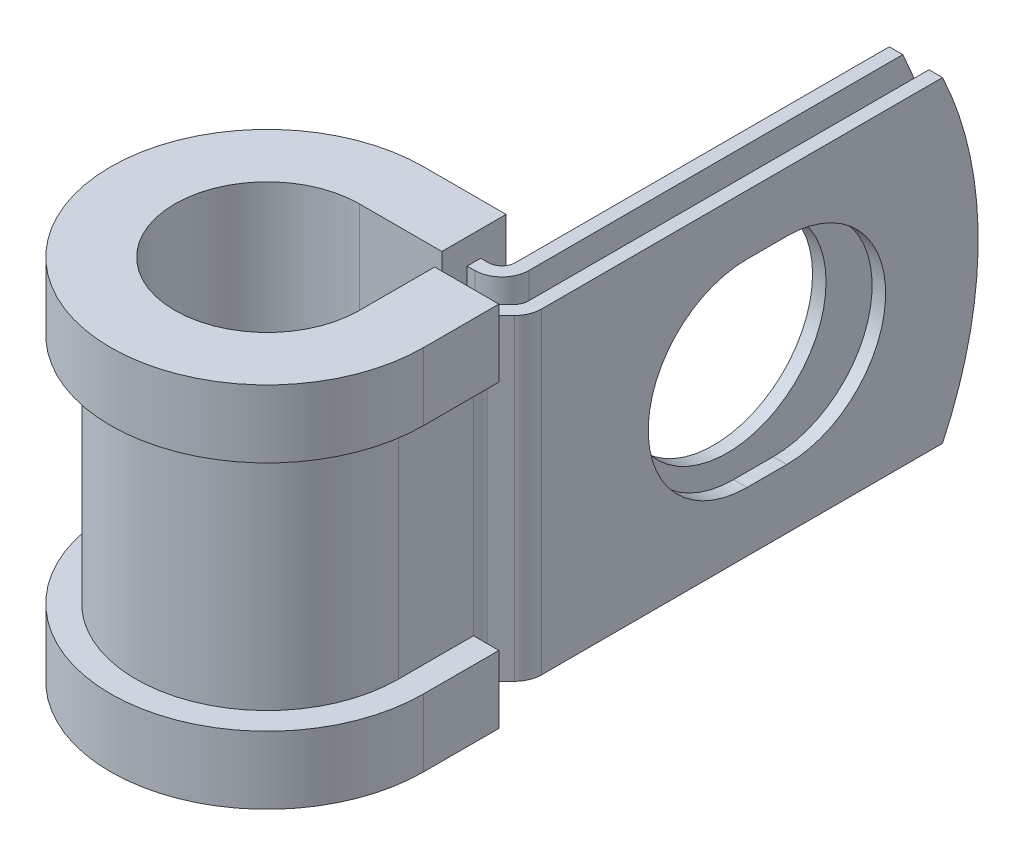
from build123d import *

# Parameters (mm, degrees)
EXTRUDE_THIN1_DEPTH = 9.525
SKETCH2_R           = 5.9436
CUT_EXTRUDE1_DEPTH  = 0.8128
CUT_EXTRUDE2_DEPTH  = 0.8128
CUT_EXTRUDE3_DEPTH  = 38.422656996


with BuildPart() as part:
    # Sketch1 → Extrude-Thin1 (new, symmetric)
    with BuildSketch(Plane(origin=(0, 0, 0), x_dir=(1, 0, 0), z_dir=(0, 1, 0))):
        with BuildLine():
            Line((8.614274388, 33.3248), (8.614274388, 7.0739))
            ThreePointArc((8.614274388, 7.0739), (8.552403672, 6.762854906), (8.37621078, 6.499163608))
            Line((8.37621078, 6.499163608), (7.550027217, 5.672980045))
            ThreePointArc((7.550027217, 5.672980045), (7.197641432, 5.145597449), (7.0739, 4.523507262))
            Line((7.0739, 4.523507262), (7.0739, 0))
            ThreePointArc((7.0739, 0), (-5.002002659, -5.002002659), (0, 7.0739))
            Line((0, 7.0739), (5.413874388, 7.0739))
            ThreePointArc((5.413874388, 7.0739), (6.563347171, 7.550027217), (7.039474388, 8.6995))
            Line((7.039474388, 8.6995), (7.039474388, 33.3248))
            Line((7.039474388, 33.3248), (6.226674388, 33.3248))
            Line((6.226674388, 33.3248), (6.226674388, 8.6995))
            ThreePointArc((6.226674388, 8.6995), (5.98861078, 8.124763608), (5.413874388, 7.8867))
            Line((5.413874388, 7.8867), (0, 7.8867))
            ThreePointArc((0, 7.8867), (-5.576739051, -5.576739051), (7.8867, 0))
            Line((7.8867, 0), (7.8867, 4.523507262))
            ThreePointArc((7.8867, 4.523507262), (7.948570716, 4.834552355), (8.124763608, 5.098243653))
            Line((8.124763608, 5.098243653), (8.950947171, 5.924427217))
            ThreePointArc((8.950947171, 5.924427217), (9.303332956, 6.451809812), (9.427074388, 7.0739))
            Line((9.427074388, 7.0739), (9.427074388, 33.3248))
            Line((9.427074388, 33.3248), (8.614274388, 33.3248))
        make_face()
    extrude(amount=EXTRUDE_THIN1_DEPTH, both=True)

    # Sketch2 → Cut-Extrude1 (cut)
    with BuildSketch(Plane.ZY.offset(-6.226674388)):
        with Locations((-20.6248, 0)):
            Circle(SKETCH2_R)
    extrude(amount=-CUT_EXTRUDE1_DEPTH, mode=Mode.SUBTRACT)

    # Sketch3 → Cut-Extrude2 (cut)
    with BuildSketch(Plane(origin=(9.427074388, 0, 0), x_dir=(0, 0, -1), z_dir=(1, 0, 0))):
        with BuildLine():
            Line((19.431, 5.9436), (21.8186, 5.9436))
            ThreePointArc((21.8186, 5.9436), (27.7622, 0), (21.8186, -5.9436))
            Line((21.8186, -5.9436), (19.431, -5.9436))
            ThreePointArc((19.431, -5.9436), (13.4874, 0), (19.431, 5.9436))
        make_face()
    extrude(amount=-CUT_EXTRUDE2_DEPTH, mode=Mode.SUBTRACT)

    # Sketch4 → Cut-Extrude3 (cut, through all)
    with BuildSketch(Plane.ZY.offset(-6.226674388)):
        with BuildLine():
            Line((-31.180263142, 9.525), (-33.3248, 9.525))
            Line((-33.3248, 9.525), (-33.3248, 0))
            ThreePointArc((-33.3248, 0), (-32.782038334, 4.881717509), (-31.180263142, 9.525))
        make_face()
        with BuildLine():
            ThreePointArc((-31.180263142, -9.525), (-32.782038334, -4.881717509), (-33.3248, 0))
            Line((-33.3248, 0), (-33.3248, -9.525))
            Line((-33.3248, -9.525), (-31.180263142, -9.525))
        make_face()
    extrude(amount=-CUT_EXTRUDE3_DEPTH, mode=Mode.SUBTRACT)

    # Sweep1: sweep along a path in Sketch6
    with BuildLine(Plane(origin=(0, 9.525, 0), x_dir=(1, 0, 0), z_dir=(0, 1, 0))) as sweep1_path:
        Line((5.5499, 4.523507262), (5.5499, 0))
        ThreePointArc((5.5499, 0), (-3.924371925, -3.924371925), (0, 5.5499))
        Line((0, 5.5499), (4.956674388, 5.5499))
    # Sketch5 → Sweep1 (sweep)
    with BuildSketch(Plane(origin=(0, 0, -4.523507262), x_dir=(-1, 0, 0), z_dir=(0, 0, -1))):
        Polygon((-7.8867, 9.525), (-7.0739, 9.525), (-7.0739, -9.525), (-7.8867, -9.525), (-7.8867, -6.985), (-9.4107, -6.985), (-9.4107, -11.049), (-5.5499, -11.049), (-5.5499, 11.049), (-9.4107, 11.049), (-9.4107, 6.985), (-7.8867, 6.985), align=None)
    sweep(path=sweep1_path.line)


solid = part.part
